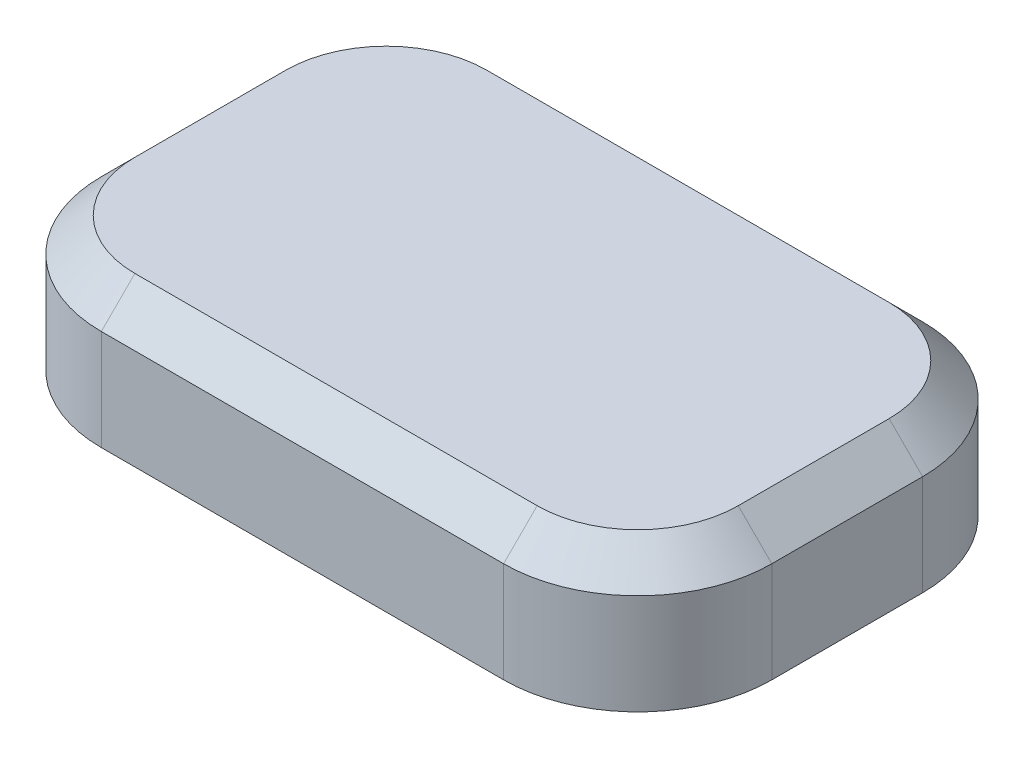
ISO-10303-21;
HEADER;
FILE_DESCRIPTION(('STEP AP214'),'2;1');
FILE_NAME('part.step','',(''),(''),'','','');
FILE_SCHEMA(('AUTOMOTIVE_DESIGN { 1 0 10303 214 1 1 1 1 }'));
ENDSEC;
DATA;
#1=APPLICATION_CONTEXT('core data for automotive mechanical design processes');
#2=APPLICATION_PROTOCOL_DEFINITION('international standard','automotive_design',2000,#1);
#3=PRODUCT_CONTEXT('',#1,'mechanical');
#4=PRODUCT('Part','Part','',(#3));
#5=PRODUCT_RELATED_PRODUCT_CATEGORY('part','',(#4));
#6=PRODUCT_DEFINITION_FORMATION('','',#4);
#7=PRODUCT_DEFINITION_CONTEXT('part definition',#1,'design');
#8=PRODUCT_DEFINITION('design','',#6,#7);
#9=PRODUCT_DEFINITION_SHAPE('','',#8);
#10=(LENGTH_UNIT() NAMED_UNIT(*) SI_UNIT(.MILLI.,.METRE.));
#11=(NAMED_UNIT(*) PLANE_ANGLE_UNIT() SI_UNIT($,.RADIAN.));
#12=(NAMED_UNIT(*) SI_UNIT($,.STERADIAN.) SOLID_ANGLE_UNIT());
#13=UNCERTAINTY_MEASURE_WITH_UNIT(LENGTH_MEASURE(1.E-05),#10,'distance_accuracy_value','');
#14=(GEOMETRIC_REPRESENTATION_CONTEXT(3) GLOBAL_UNCERTAINTY_ASSIGNED_CONTEXT((#13)) GLOBAL_UNIT_ASSIGNED_CONTEXT((#10,
#11,#12)) REPRESENTATION_CONTEXT('',''));
#15=CARTESIAN_POINT('',(0.,0.,0.));
#16=DIRECTION('',(0.,0.,1.));
#17=DIRECTION('',(1.,0.,0.));
#18=AXIS2_PLACEMENT_3D('',#15,#16,#17);
#19=CARTESIAN_POINT('',(-100.,40.,-62.5));
#20=DIRECTION('',(1.,0.,0.));
#21=DIRECTION('',(0.,0.,-1.));
#22=AXIS2_PLACEMENT_3D('',#19,#20,#21);
#23=PLANE('',#22);
#24=DIRECTION('',(0.,-1.,0.));
#25=VECTOR('',#24,1.);
#26=CARTESIAN_POINT('',(-100.,40.,22.5));
#27=LINE('',#26,#25);
#28=CARTESIAN_POINT('',(-100.,0.,22.5));
#29=VERTEX_POINT('',#28);
#30=CARTESIAN_POINT('',(-100.,29.9999999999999,22.5));
#31=VERTEX_POINT('',#30);
#32=EDGE_CURVE('E133',#29,#31,#27,.F.);
#33=ORIENTED_EDGE('',*,*,#32,.T.);
#34=DIRECTION('',(0.,0.,-1.));
#35=VECTOR('',#34,1.);
#36=CARTESIAN_POINT('',(-100.,29.9999999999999,-22.5));
#37=LINE('',#36,#35);
#38=CARTESIAN_POINT('',(-100.,29.9999999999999,-22.5));
#39=VERTEX_POINT('',#38);
#40=EDGE_CURVE('E129',#31,#39,#37,.T.);
#41=ORIENTED_EDGE('',*,*,#40,.T.);
#42=DIRECTION('',(0.,-1.,0.));
#43=VECTOR('',#42,1.);
#44=CARTESIAN_POINT('',(-100.,40.,-22.5));
#45=LINE('',#44,#43);
#46=CARTESIAN_POINT('',(-100.,0.,-22.5));
#47=VERTEX_POINT('',#46);
#48=EDGE_CURVE('E122',#39,#47,#45,.T.);
#49=ORIENTED_EDGE('',*,*,#48,.T.);
#50=DIRECTION('',(0.,0.,1.));
#51=VECTOR('',#50,1.);
#52=CARTESIAN_POINT('',(-100.,0.,-62.5));
#53=LINE('',#52,#51);
#54=EDGE_CURVE('E126',#47,#29,#53,.T.);
#55=ORIENTED_EDGE('',*,*,#54,.T.);
#56=EDGE_LOOP('',(#33,#41,#49,#55));
#57=FACE_BOUND('',#56,.T.);
#58=ADVANCED_FACE('F32',(#57),#23,.F.);
#59=CARTESIAN_POINT('',(-100.,40.,62.5));
#60=DIRECTION('',(0.,0.,-1.));
#61=DIRECTION('',(-1.,0.,0.));
#62=AXIS2_PLACEMENT_3D('',#59,#60,#61);
#63=PLANE('',#62);
#64=DIRECTION('',(0.,-1.,0.));
#65=VECTOR('',#64,1.);
#66=CARTESIAN_POINT('',(60.,40.,62.5));
#67=LINE('',#66,#65);
#68=CARTESIAN_POINT('',(60.,0.,62.5));
#69=VERTEX_POINT('',#68);
#70=CARTESIAN_POINT('',(60.,29.9999999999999,62.5));
#71=VERTEX_POINT('',#70);
#72=EDGE_CURVE('E168',#69,#71,#67,.F.);
#73=ORIENTED_EDGE('',*,*,#72,.T.);
#74=DIRECTION('',(-1.,0.,0.));
#75=VECTOR('',#74,1.);
#76=CARTESIAN_POINT('',(-60.,29.9999999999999,62.5));
#77=LINE('',#76,#75);
#78=CARTESIAN_POINT('',(-60.,29.9999999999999,62.5));
#79=VERTEX_POINT('',#78);
#80=EDGE_CURVE('E11',#71,#79,#77,.T.);
#81=ORIENTED_EDGE('',*,*,#80,.T.);
#82=DIRECTION('',(0.,-1.,0.));
#83=VECTOR('',#82,1.);
#84=CARTESIAN_POINT('',(-60.,40.,62.5));
#85=LINE('',#84,#83);
#86=CARTESIAN_POINT('',(-60.,0.,62.5));
#87=VERTEX_POINT('',#86);
#88=EDGE_CURVE('E170',#79,#87,#85,.T.);
#89=ORIENTED_EDGE('',*,*,#88,.T.);
#90=DIRECTION('',(1.,0.,0.));
#91=VECTOR('',#90,1.);
#92=CARTESIAN_POINT('',(-100.,0.,62.5));
#93=LINE('',#92,#91);
#94=EDGE_CURVE('E149',#87,#69,#93,.T.);
#95=ORIENTED_EDGE('',*,*,#94,.T.);
#96=EDGE_LOOP('',(#73,#81,#89,#95));
#97=FACE_BOUND('',#96,.T.);
#98=ADVANCED_FACE('F278',(#97),#63,.F.);
#99=CARTESIAN_POINT('',(100.,40.,-62.5));
#100=DIRECTION('',(-1.,0.,0.));
#101=DIRECTION('',(0.,0.,1.));
#102=AXIS2_PLACEMENT_3D('',#99,#100,#101);
#103=PLANE('',#102);
#104=DIRECTION('',(0.,-1.,0.));
#105=VECTOR('',#104,1.);
#106=CARTESIAN_POINT('',(100.,40.,-22.5));
#107=LINE('',#106,#105);
#108=CARTESIAN_POINT('',(100.,0.,-22.5));
#109=VERTEX_POINT('',#108);
#110=CARTESIAN_POINT('',(100.,29.9999999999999,-22.5));
#111=VERTEX_POINT('',#110);
#112=EDGE_CURVE('E174',#109,#111,#107,.F.);
#113=ORIENTED_EDGE('',*,*,#112,.T.);
#114=DIRECTION('',(0.,0.,1.));
#115=VECTOR('',#114,1.);
#116=CARTESIAN_POINT('',(100.,29.9999999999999,22.5));
#117=LINE('',#116,#115);
#118=CARTESIAN_POINT('',(100.,29.9999999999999,22.5));
#119=VERTEX_POINT('',#118);
#120=EDGE_CURVE('E202',#111,#119,#117,.T.);
#121=ORIENTED_EDGE('',*,*,#120,.T.);
#122=DIRECTION('',(0.,-1.,0.));
#123=VECTOR('',#122,1.);
#124=CARTESIAN_POINT('',(100.,40.,22.5));
#125=LINE('',#124,#123);
#126=CARTESIAN_POINT('',(100.,0.,22.5));
#127=VERTEX_POINT('',#126);
#128=EDGE_CURVE('E172',#119,#127,#125,.T.);
#129=ORIENTED_EDGE('',*,*,#128,.T.);
#130=DIRECTION('',(0.,0.,-1.));
#131=VECTOR('',#130,1.);
#132=CARTESIAN_POINT('',(100.,0.,-62.5));
#133=LINE('',#132,#131);
#134=EDGE_CURVE('E152',#127,#109,#133,.T.);
#135=ORIENTED_EDGE('',*,*,#134,.T.);
#136=EDGE_LOOP('',(#113,#121,#129,#135));
#137=FACE_BOUND('',#136,.T.);
#138=ADVANCED_FACE('F263',(#137),#103,.F.);
#139=CARTESIAN_POINT('',(-100.,40.,-62.5));
#140=DIRECTION('',(0.,0.,1.));
#141=DIRECTION('',(1.,0.,0.));
#142=AXIS2_PLACEMENT_3D('',#139,#140,#141);
#143=PLANE('',#142);
#144=DIRECTION('',(0.,-1.,0.));
#145=VECTOR('',#144,1.);
#146=CARTESIAN_POINT('',(-60.,40.,-62.5));
#147=LINE('',#146,#145);
#148=CARTESIAN_POINT('',(-60.,0.,-62.5));
#149=VERTEX_POINT('',#148);
#150=CARTESIAN_POINT('',(-60.,29.9999999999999,-62.5));
#151=VERTEX_POINT('',#150);
#152=EDGE_CURVE('E139',#149,#151,#147,.F.);
#153=ORIENTED_EDGE('',*,*,#152,.T.);
#154=DIRECTION('',(1.,0.,0.));
#155=VECTOR('',#154,1.);
#156=CARTESIAN_POINT('',(60.,29.9999999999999,-62.5));
#157=LINE('',#156,#155);
#158=CARTESIAN_POINT('',(60.,29.9999999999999,-62.5));
#159=VERTEX_POINT('',#158);
#160=EDGE_CURVE('E194',#151,#159,#157,.T.);
#161=ORIENTED_EDGE('',*,*,#160,.T.);
#162=DIRECTION('',(0.,-1.,0.));
#163=VECTOR('',#162,1.);
#164=CARTESIAN_POINT('',(60.,40.,-62.5));
#165=LINE('',#164,#163);
#166=CARTESIAN_POINT('',(60.,0.,-62.5));
#167=VERTEX_POINT('',#166);
#168=EDGE_CURVE('E143',#159,#167,#165,.T.);
#169=ORIENTED_EDGE('',*,*,#168,.T.);
#170=DIRECTION('',(-1.,0.,0.));
#171=VECTOR('',#170,1.);
#172=CARTESIAN_POINT('',(-100.,0.,-62.5));
#173=LINE('',#172,#171);
#174=EDGE_CURVE('E159',#167,#149,#173,.T.);
#175=ORIENTED_EDGE('',*,*,#174,.T.);
#176=EDGE_LOOP('',(#153,#161,#169,#175));
#177=FACE_BOUND('',#176,.T.);
#178=ADVANCED_FACE('F246',(#177),#143,.F.);
#179=CARTESIAN_POINT('',(-100.,40.,62.5));
#180=DIRECTION('',(0.,1.,0.));
#181=DIRECTION('',(0.,0.,1.));
#182=AXIS2_PLACEMENT_3D('',#179,#180,#181);
#183=PLANE('',#182);
#184=CARTESIAN_POINT('',(60.,40.,-22.5));
#185=DIRECTION('',(0.,1.,0.));
#186=DIRECTION('',(0.,0.,1.));
#187=AXIS2_PLACEMENT_3D('',#184,#185,#186);
#188=CIRCLE('',#187,30.);
#189=CARTESIAN_POINT('',(90.,40.,-22.5));
#190=VERTEX_POINT('',#189);
#191=CARTESIAN_POINT('',(60.,40.,-52.5));
#192=VERTEX_POINT('',#191);
#193=EDGE_CURVE('E187',#190,#192,#188,.T.);
#194=ORIENTED_EDGE('',*,*,#193,.T.);
#195=DIRECTION('',(-1.,0.,0.));
#196=VECTOR('',#195,1.);
#197=CARTESIAN_POINT('',(-60.,40.,-52.5));
#198=LINE('',#197,#196);
#199=CARTESIAN_POINT('',(-60.,40.,-52.5));
#200=VERTEX_POINT('',#199);
#201=EDGE_CURVE('E191',#192,#200,#198,.T.);
#202=ORIENTED_EDGE('',*,*,#201,.T.);
#203=CARTESIAN_POINT('',(-60.,40.,-22.5));
#204=DIRECTION('',(0.,1.,0.));
#205=DIRECTION('',(0.,0.,1.));
#206=AXIS2_PLACEMENT_3D('',#203,#204,#205);
#207=CIRCLE('',#206,30.);
#208=CARTESIAN_POINT('',(-90.,40.,-22.5));
#209=VERTEX_POINT('',#208);
#210=EDGE_CURVE('E189',#200,#209,#207,.T.);
#211=ORIENTED_EDGE('',*,*,#210,.T.);
#212=DIRECTION('',(0.,0.,1.));
#213=VECTOR('',#212,1.);
#214=CARTESIAN_POINT('',(-90.,40.,22.5));
#215=LINE('',#214,#213);
#216=CARTESIAN_POINT('',(-90.,40.,22.5));
#217=VERTEX_POINT('',#216);
#218=EDGE_CURVE('E185',#209,#217,#215,.T.);
#219=ORIENTED_EDGE('',*,*,#218,.T.);
#220=CARTESIAN_POINT('',(-60.,40.,22.5));
#221=DIRECTION('',(0.,1.,0.));
#222=DIRECTION('',(0.,0.,1.));
#223=AXIS2_PLACEMENT_3D('',#220,#221,#222);
#224=CIRCLE('',#223,30.);
#225=CARTESIAN_POINT('',(-60.,40.,52.5));
#226=VERTEX_POINT('',#225);
#227=EDGE_CURVE('E181',#217,#226,#224,.T.);
#228=ORIENTED_EDGE('',*,*,#227,.T.);
#229=DIRECTION('',(1.,0.,0.));
#230=VECTOR('',#229,1.);
#231=CARTESIAN_POINT('',(60.,40.,52.5));
#232=LINE('',#231,#230);
#233=CARTESIAN_POINT('',(60.,40.,52.5));
#234=VERTEX_POINT('',#233);
#235=EDGE_CURVE('E177',#226,#234,#232,.T.);
#236=ORIENTED_EDGE('',*,*,#235,.T.);
#237=CARTESIAN_POINT('',(60.,40.,22.5));
#238=DIRECTION('',(0.,1.,0.));
#239=DIRECTION('',(0.,0.,1.));
#240=AXIS2_PLACEMENT_3D('',#237,#238,#239);
#241=CIRCLE('',#240,30.);
#242=CARTESIAN_POINT('',(90.,40.,22.5));
#243=VERTEX_POINT('',#242);
#244=EDGE_CURVE('E179',#234,#243,#241,.T.);
#245=ORIENTED_EDGE('',*,*,#244,.T.);
#246=DIRECTION('',(0.,0.,-1.));
#247=VECTOR('',#246,1.);
#248=CARTESIAN_POINT('',(90.,40.,-22.5));
#249=LINE('',#248,#247);
#250=EDGE_CURVE('E183',#243,#190,#249,.T.);
#251=ORIENTED_EDGE('',*,*,#250,.T.);
#252=EDGE_LOOP('',(#194,#202,#211,#219,#228,#236,#245,#251));
#253=FACE_BOUND('',#252,.T.);
#254=ADVANCED_FACE('F234',(#253),#183,.T.);
#255=CARTESIAN_POINT('',(-100.,0.,62.5));
#256=DIRECTION('',(0.,1.,0.));
#257=DIRECTION('',(0.,0.,1.));
#258=AXIS2_PLACEMENT_3D('',#255,#256,#257);
#259=PLANE('',#258);
#260=ORIENTED_EDGE('',*,*,#54,.F.);
#261=CARTESIAN_POINT('',(-60.,0.,-22.5));
#262=DIRECTION('',(0.,1.,0.));
#263=DIRECTION('',(0.,0.,1.));
#264=AXIS2_PLACEMENT_3D('',#261,#262,#263);
#265=CIRCLE('',#264,40.);
#266=EDGE_CURVE('E136',#47,#149,#265,.F.);
#267=ORIENTED_EDGE('',*,*,#266,.T.);
#268=ORIENTED_EDGE('',*,*,#174,.F.);
#269=CARTESIAN_POINT('',(60.,0.,-22.5));
#270=DIRECTION('',(0.,1.,0.));
#271=DIRECTION('',(0.,0.,1.));
#272=AXIS2_PLACEMENT_3D('',#269,#270,#271);
#273=CIRCLE('',#272,40.);
#274=EDGE_CURVE('E163',#167,#109,#273,.F.);
#275=ORIENTED_EDGE('',*,*,#274,.T.);
#276=ORIENTED_EDGE('',*,*,#134,.F.);
#277=CARTESIAN_POINT('',(60.,0.,22.5));
#278=DIRECTION('',(0.,1.,0.));
#279=DIRECTION('',(0.,0.,1.));
#280=AXIS2_PLACEMENT_3D('',#277,#278,#279);
#281=CIRCLE('',#280,40.);
#282=EDGE_CURVE('E132',#127,#69,#281,.F.);
#283=ORIENTED_EDGE('',*,*,#282,.T.);
#284=ORIENTED_EDGE('',*,*,#94,.F.);
#285=CARTESIAN_POINT('',(-60.,0.,22.5));
#286=DIRECTION('',(0.,1.,0.));
#287=DIRECTION('',(0.,0.,1.));
#288=AXIS2_PLACEMENT_3D('',#285,#286,#287);
#289=CIRCLE('',#288,40.);
#290=EDGE_CURVE('E144',#87,#29,#289,.F.);
#291=ORIENTED_EDGE('',*,*,#290,.T.);
#292=EDGE_LOOP('',(#260,#267,#268,#275,#276,#283,#284,#291));
#293=FACE_BOUND('',#292,.T.);
#294=ADVANCED_FACE('F146',(#293),#259,.F.);
#295=CARTESIAN_POINT('',(-60.,40.,-22.5));
#296=DIRECTION('',(0.,-1.,0.));
#297=DIRECTION('',(0.,0.,-1.));
#298=AXIS2_PLACEMENT_3D('',#295,#296,#297);
#299=CYLINDRICAL_SURFACE('',#298,40.);
#300=ORIENTED_EDGE('',*,*,#48,.F.);
#301=CARTESIAN_POINT('',(-60.,29.9999999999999,-22.5));
#302=DIRECTION('',(0.,1.,0.));
#303=DIRECTION('',(0.,0.,1.));
#304=AXIS2_PLACEMENT_3D('',#301,#302,#303);
#305=CIRCLE('',#304,40.);
#306=EDGE_CURVE('E197',#39,#151,#305,.F.);
#307=ORIENTED_EDGE('',*,*,#306,.T.);
#308=ORIENTED_EDGE('',*,*,#152,.F.);
#309=ORIENTED_EDGE('',*,*,#266,.F.);
#310=EDGE_LOOP('',(#300,#307,#308,#309));
#311=FACE_BOUND('',#310,.T.);
#312=ADVANCED_FACE('F137',(#311),#299,.T.);
#313=CARTESIAN_POINT('',(-60.,40.,22.5));
#314=DIRECTION('',(0.,-1.,0.));
#315=DIRECTION('',(0.,0.,-1.));
#316=AXIS2_PLACEMENT_3D('',#313,#314,#315);
#317=CYLINDRICAL_SURFACE('',#316,40.);
#318=ORIENTED_EDGE('',*,*,#88,.F.);
#319=CARTESIAN_POINT('',(-60.,29.9999999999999,22.5));
#320=DIRECTION('',(0.,1.,0.));
#321=DIRECTION('',(0.,0.,1.));
#322=AXIS2_PLACEMENT_3D('',#319,#320,#321);
#323=CIRCLE('',#322,40.);
#324=EDGE_CURVE('E204',#79,#31,#323,.F.);
#325=ORIENTED_EDGE('',*,*,#324,.T.);
#326=ORIENTED_EDGE('',*,*,#32,.F.);
#327=ORIENTED_EDGE('',*,*,#290,.F.);
#328=EDGE_LOOP('',(#318,#325,#326,#327));
#329=FACE_BOUND('',#328,.T.);
#330=ADVANCED_FACE('F288',(#329),#317,.T.);
#331=CARTESIAN_POINT('',(60.,40.,-22.5));
#332=DIRECTION('',(0.,-1.,0.));
#333=DIRECTION('',(0.,0.,-1.));
#334=AXIS2_PLACEMENT_3D('',#331,#332,#333);
#335=CYLINDRICAL_SURFACE('',#334,40.);
#336=ORIENTED_EDGE('',*,*,#168,.F.);
#337=CARTESIAN_POINT('',(60.,29.9999999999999,-22.5));
#338=DIRECTION('',(0.,1.,0.));
#339=DIRECTION('',(0.,0.,1.));
#340=AXIS2_PLACEMENT_3D('',#337,#338,#339);
#341=CIRCLE('',#340,40.);
#342=EDGE_CURVE('E199',#159,#111,#341,.F.);
#343=ORIENTED_EDGE('',*,*,#342,.T.);
#344=ORIENTED_EDGE('',*,*,#112,.F.);
#345=ORIENTED_EDGE('',*,*,#274,.F.);
#346=EDGE_LOOP('',(#336,#343,#344,#345));
#347=FACE_BOUND('',#346,.T.);
#348=ADVANCED_FACE('F259',(#347),#335,.T.);
#349=CARTESIAN_POINT('',(60.,40.,22.5));
#350=DIRECTION('',(0.,-1.,0.));
#351=DIRECTION('',(0.,0.,-1.));
#352=AXIS2_PLACEMENT_3D('',#349,#350,#351);
#353=CYLINDRICAL_SURFACE('',#352,40.);
#354=ORIENTED_EDGE('',*,*,#128,.F.);
#355=CARTESIAN_POINT('',(60.,29.9999999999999,22.5));
#356=DIRECTION('',(0.,1.,0.));
#357=DIRECTION('',(0.,0.,1.));
#358=AXIS2_PLACEMENT_3D('',#355,#356,#357);
#359=CIRCLE('',#358,40.);
#360=EDGE_CURVE('E41',#119,#71,#359,.F.);
#361=ORIENTED_EDGE('',*,*,#360,.T.);
#362=ORIENTED_EDGE('',*,*,#72,.F.);
#363=ORIENTED_EDGE('',*,*,#282,.F.);
#364=EDGE_LOOP('',(#354,#361,#362,#363));
#365=FACE_BOUND('',#364,.T.);
#366=ADVANCED_FACE('F276',(#365),#353,.T.);
#367=CARTESIAN_POINT('',(-100.,40.,52.5));
#368=DIRECTION('',(0.,0.707106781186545,0.707106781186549));
#369=DIRECTION('',(0.,-0.707106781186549,0.707106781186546));
#370=AXIS2_PLACEMENT_3D('',#367,#368,#369);
#371=PLANE('',#370);
#372=DIRECTION('',(0.,0.707106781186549,-0.707106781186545));
#373=VECTOR('',#372,1.);
#374=CARTESIAN_POINT('',(-60.,29.9999999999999,62.5));
#375=LINE('',#374,#373);
#376=EDGE_CURVE('E155',#79,#226,#375,.T.);
#377=ORIENTED_EDGE('',*,*,#376,.F.);
#378=ORIENTED_EDGE('',*,*,#80,.F.);
#379=DIRECTION('',(0.,-0.707106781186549,0.707106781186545));
#380=VECTOR('',#379,1.);
#381=CARTESIAN_POINT('',(60.,40.,52.5));
#382=LINE('',#381,#380);
#383=EDGE_CURVE('E36',#234,#71,#382,.T.);
#384=ORIENTED_EDGE('',*,*,#383,.F.);
#385=ORIENTED_EDGE('',*,*,#235,.F.);
#386=EDGE_LOOP('',(#377,#378,#384,#385));
#387=FACE_BOUND('',#386,.T.);
#388=ADVANCED_FACE('F34',(#387),#371,.T.);
#389=CARTESIAN_POINT('',(60.,40.,22.5));
#390=DIRECTION('',(0.,-1.,0.));
#391=DIRECTION('',(0.,0.,-1.));
#392=AXIS2_PLACEMENT_3D('',#389,#390,#391);
#393=CONICAL_SURFACE('',#392,30.,0.785398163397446);
#394=ORIENTED_EDGE('',*,*,#383,.T.);
#395=ORIENTED_EDGE('',*,*,#360,.F.);
#396=DIRECTION('',(0.707106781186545,-0.707106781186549,0.));
#397=VECTOR('',#396,1.);
#398=CARTESIAN_POINT('',(90.,40.,22.5));
#399=LINE('',#398,#397);
#400=EDGE_CURVE('E220',#243,#119,#399,.T.);
#401=ORIENTED_EDGE('',*,*,#400,.F.);
#402=ORIENTED_EDGE('',*,*,#244,.F.);
#403=EDGE_LOOP('',(#394,#395,#401,#402));
#404=FACE_BOUND('',#403,.T.);
#405=ADVANCED_FACE('F269',(#404),#393,.T.);
#406=CARTESIAN_POINT('',(-60.,40.,22.5));
#407=DIRECTION('',(0.,-1.,0.));
#408=DIRECTION('',(0.,0.,-1.));
#409=AXIS2_PLACEMENT_3D('',#406,#407,#408);
#410=CONICAL_SURFACE('',#409,30.,0.785398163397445);
#411=ORIENTED_EDGE('',*,*,#376,.T.);
#412=ORIENTED_EDGE('',*,*,#227,.F.);
#413=DIRECTION('',(0.707106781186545,0.707106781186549,0.));
#414=VECTOR('',#413,1.);
#415=CARTESIAN_POINT('',(-100.,29.9999999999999,22.5));
#416=LINE('',#415,#414);
#417=EDGE_CURVE('E217',#31,#217,#416,.T.);
#418=ORIENTED_EDGE('',*,*,#417,.F.);
#419=ORIENTED_EDGE('',*,*,#324,.F.);
#420=EDGE_LOOP('',(#411,#412,#418,#419));
#421=FACE_BOUND('',#420,.T.);
#422=ADVANCED_FACE('F227',(#421),#410,.T.);
#423=CARTESIAN_POINT('',(90.,40.,62.5));
#424=DIRECTION('',(0.707106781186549,0.707106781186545,0.));
#425=DIRECTION('',(-0.707106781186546,0.707106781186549,0.));
#426=AXIS2_PLACEMENT_3D('',#423,#424,#425);
#427=PLANE('',#426);
#428=ORIENTED_EDGE('',*,*,#400,.T.);
#429=ORIENTED_EDGE('',*,*,#120,.F.);
#430=DIRECTION('',(0.707106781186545,-0.707106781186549,0.));
#431=VECTOR('',#430,1.);
#432=CARTESIAN_POINT('',(90.,40.,-22.5));
#433=LINE('',#432,#431);
#434=EDGE_CURVE('E214',#190,#111,#433,.T.);
#435=ORIENTED_EDGE('',*,*,#434,.F.);
#436=ORIENTED_EDGE('',*,*,#250,.F.);
#437=EDGE_LOOP('',(#428,#429,#435,#436));
#438=FACE_BOUND('',#437,.T.);
#439=ADVANCED_FACE('F266',(#438),#427,.T.);
#440=CARTESIAN_POINT('',(-90.,40.,62.5));
#441=DIRECTION('',(-0.707106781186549,0.707106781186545,0.));
#442=DIRECTION('',(-0.707106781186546,-0.707106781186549,0.));
#443=AXIS2_PLACEMENT_3D('',#440,#441,#442);
#444=PLANE('',#443);
#445=ORIENTED_EDGE('',*,*,#417,.T.);
#446=ORIENTED_EDGE('',*,*,#218,.F.);
#447=DIRECTION('',(0.707106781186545,0.70710678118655,0.));
#448=VECTOR('',#447,1.);
#449=CARTESIAN_POINT('',(-100.,29.9999999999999,-22.5));
#450=LINE('',#449,#448);
#451=EDGE_CURVE('E211',#39,#209,#450,.T.);
#452=ORIENTED_EDGE('',*,*,#451,.F.);
#453=ORIENTED_EDGE('',*,*,#40,.F.);
#454=EDGE_LOOP('',(#445,#446,#452,#453));
#455=FACE_BOUND('',#454,.T.);
#456=ADVANCED_FACE('F239',(#455),#444,.T.);
#457=CARTESIAN_POINT('',(60.,40.,-22.5));
#458=DIRECTION('',(0.,-1.,0.));
#459=DIRECTION('',(0.,0.,-1.));
#460=AXIS2_PLACEMENT_3D('',#457,#458,#459);
#461=CONICAL_SURFACE('',#460,30.,0.785398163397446);
#462=ORIENTED_EDGE('',*,*,#434,.T.);
#463=ORIENTED_EDGE('',*,*,#342,.F.);
#464=DIRECTION('',(0.,-0.707106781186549,-0.707106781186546));
#465=VECTOR('',#464,1.);
#466=CARTESIAN_POINT('',(60.,40.,-52.5));
#467=LINE('',#466,#465);
#468=EDGE_CURVE('E209',#192,#159,#467,.T.);
#469=ORIENTED_EDGE('',*,*,#468,.F.);
#470=ORIENTED_EDGE('',*,*,#193,.F.);
#471=EDGE_LOOP('',(#462,#463,#469,#470));
#472=FACE_BOUND('',#471,.T.);
#473=ADVANCED_FACE('F255',(#472),#461,.T.);
#474=CARTESIAN_POINT('',(-60.,40.,-22.5));
#475=DIRECTION('',(0.,-1.,0.));
#476=DIRECTION('',(0.,0.,-1.));
#477=AXIS2_PLACEMENT_3D('',#474,#475,#476);
#478=CONICAL_SURFACE('',#477,30.,0.785398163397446);
#479=ORIENTED_EDGE('',*,*,#451,.T.);
#480=ORIENTED_EDGE('',*,*,#210,.F.);
#481=DIRECTION('',(0.,0.70710678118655,0.707106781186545));
#482=VECTOR('',#481,1.);
#483=CARTESIAN_POINT('',(-60.,29.9999999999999,-62.5));
#484=LINE('',#483,#482);
#485=EDGE_CURVE('E207',#151,#200,#484,.T.);
#486=ORIENTED_EDGE('',*,*,#485,.F.);
#487=ORIENTED_EDGE('',*,*,#306,.F.);
#488=EDGE_LOOP('',(#479,#480,#486,#487));
#489=FACE_BOUND('',#488,.T.);
#490=ADVANCED_FACE('F242',(#489),#478,.T.);
#491=CARTESIAN_POINT('',(-100.,40.,-52.5));
#492=DIRECTION('',(0.,0.707106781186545,-0.707106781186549));
#493=DIRECTION('',(0.,0.707106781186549,0.707106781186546));
#494=AXIS2_PLACEMENT_3D('',#491,#492,#493);
#495=PLANE('',#494);
#496=ORIENTED_EDGE('',*,*,#468,.T.);
#497=ORIENTED_EDGE('',*,*,#160,.F.);
#498=ORIENTED_EDGE('',*,*,#485,.T.);
#499=ORIENTED_EDGE('',*,*,#201,.F.);
#500=EDGE_LOOP('',(#496,#497,#498,#499));
#501=FACE_BOUND('',#500,.T.);
#502=ADVANCED_FACE('F249',(#501),#495,.T.);
#503=CLOSED_SHELL('',(#58,#98,#138,#178,#254,#294,#312,#330,#348,#366,#388,#405,#422,#439,#456,
#473,#490,#502));
#504=MANIFOLD_SOLID_BREP('B2',#503);
#505=ADVANCED_BREP_SHAPE_REPRESENTATION('',(#18,#504),#14);
#506=SHAPE_DEFINITION_REPRESENTATION(#9,#505);
ENDSEC;
END-ISO-10303-21;
